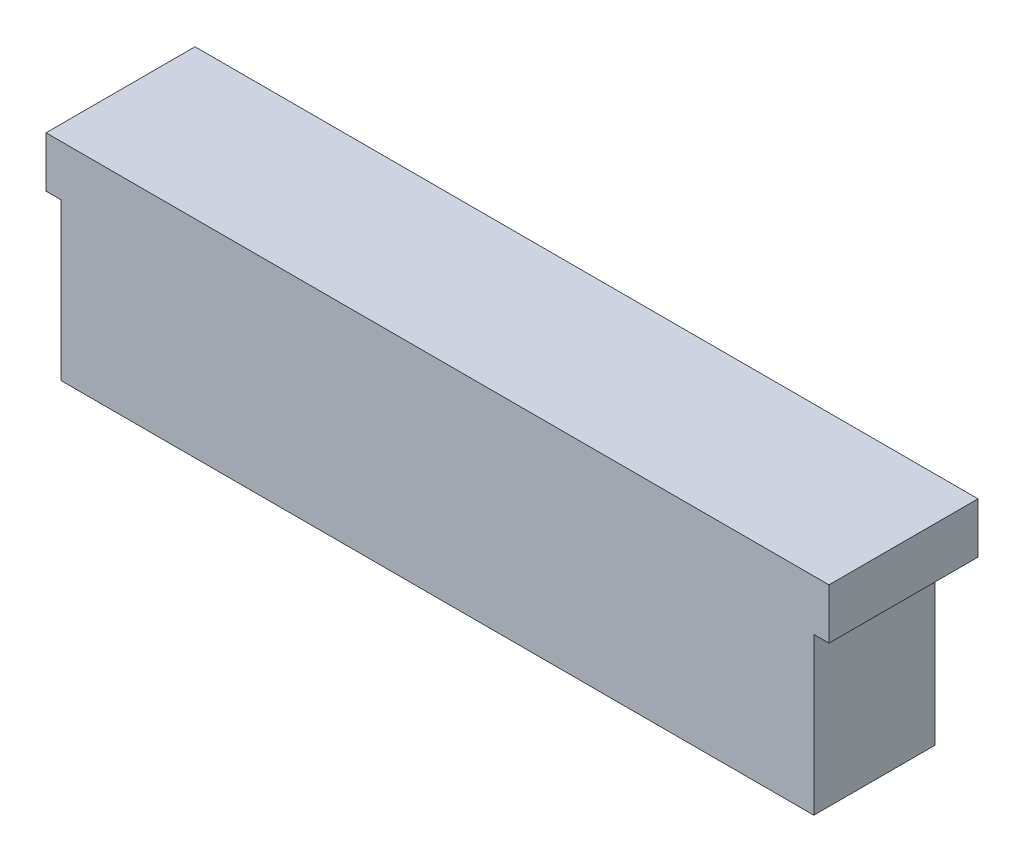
ISO-10303-21;
HEADER;
FILE_DESCRIPTION(('STEP AP214'),'2;1');
FILE_NAME('part.step','',(''),(''),'','','');
FILE_SCHEMA(('AUTOMOTIVE_DESIGN { 1 0 10303 214 1 1 1 1 }'));
ENDSEC;
DATA;
#1=APPLICATION_CONTEXT('core data for automotive mechanical design processes');
#2=APPLICATION_PROTOCOL_DEFINITION('international standard','automotive_design',2000,#1);
#3=PRODUCT_CONTEXT('',#1,'mechanical');
#4=PRODUCT('Part','Part','',(#3));
#5=PRODUCT_RELATED_PRODUCT_CATEGORY('part','',(#4));
#6=PRODUCT_DEFINITION_FORMATION('','',#4);
#7=PRODUCT_DEFINITION_CONTEXT('part definition',#1,'design');
#8=PRODUCT_DEFINITION('design','',#6,#7);
#9=PRODUCT_DEFINITION_SHAPE('','',#8);
#10=(LENGTH_UNIT() NAMED_UNIT(*) SI_UNIT(.MILLI.,.METRE.));
#11=(NAMED_UNIT(*) PLANE_ANGLE_UNIT() SI_UNIT($,.RADIAN.));
#12=(NAMED_UNIT(*) SI_UNIT($,.STERADIAN.) SOLID_ANGLE_UNIT());
#13=UNCERTAINTY_MEASURE_WITH_UNIT(LENGTH_MEASURE(1.E-05),#10,'distance_accuracy_value','');
#14=(GEOMETRIC_REPRESENTATION_CONTEXT(3) GLOBAL_UNCERTAINTY_ASSIGNED_CONTEXT((#13)) GLOBAL_UNIT_ASSIGNED_CONTEXT((#10,
#11,#12)) REPRESENTATION_CONTEXT('',''));
#15=CARTESIAN_POINT('',(0.,0.,0.));
#16=DIRECTION('',(0.,0.,1.));
#17=DIRECTION('',(1.,0.,0.));
#18=AXIS2_PLACEMENT_3D('',#15,#16,#17);
#19=CARTESIAN_POINT('',(7.75,3.1,-1.75));
#20=DIRECTION('',(1.,0.,0.));
#21=DIRECTION('',(0.,1.,0.));
#22=AXIS2_PLACEMENT_3D('',#19,#20,#21);
#23=PLANE('',#22);
#24=DIRECTION('',(0.,0.,-1.));
#25=VECTOR('',#24,1.);
#26=CARTESIAN_POINT('',(7.75,4.1,-1.75));
#27=LINE('',#26,#25);
#28=CARTESIAN_POINT('',(7.75,4.1,1.2));
#29=VERTEX_POINT('',#28);
#30=CARTESIAN_POINT('',(7.75,4.1,-1.75));
#31=VERTEX_POINT('',#30);
#32=EDGE_CURVE('E115',#29,#31,#27,.T.);
#33=ORIENTED_EDGE('',*,*,#32,.F.);
#34=DIRECTION('',(0.,1.,0.));
#35=VECTOR('',#34,1.);
#36=CARTESIAN_POINT('',(7.75,3.1,1.2));
#37=LINE('',#36,#35);
#38=CARTESIAN_POINT('',(7.75,3.1,1.2));
#39=VERTEX_POINT('',#38);
#40=EDGE_CURVE('E157',#39,#29,#37,.T.);
#41=ORIENTED_EDGE('',*,*,#40,.F.);
#42=DIRECTION('',(0.,0.,-1.));
#43=VECTOR('',#42,1.);
#44=CARTESIAN_POINT('',(7.75,3.1,-1.75));
#45=LINE('',#44,#43);
#46=CARTESIAN_POINT('',(7.75,3.1,-1.75));
#47=VERTEX_POINT('',#46);
#48=EDGE_CURVE('E182',#39,#47,#45,.T.);
#49=ORIENTED_EDGE('',*,*,#48,.T.);
#50=DIRECTION('',(0.,1.,0.));
#51=VECTOR('',#50,1.);
#52=CARTESIAN_POINT('',(7.75,3.1,-1.75));
#53=LINE('',#52,#51);
#54=EDGE_CURVE('E11',#47,#31,#53,.T.);
#55=ORIENTED_EDGE('',*,*,#54,.T.);
#56=EDGE_LOOP('',(#33,#41,#49,#55));
#57=FACE_BOUND('',#56,.T.);
#58=ADVANCED_FACE('F17',(#57),#23,.T.);
#59=CARTESIAN_POINT('',(7.75,3.1,-1.75));
#60=DIRECTION('',(0.,0.,-1.));
#61=DIRECTION('',(-1.,0.,0.));
#62=AXIS2_PLACEMENT_3D('',#59,#60,#61);
#63=PLANE('',#62);
#64=DIRECTION('',(-1.,0.,0.));
#65=VECTOR('',#64,1.);
#66=CARTESIAN_POINT('',(7.75,4.1,-1.75));
#67=LINE('',#66,#65);
#68=CARTESIAN_POINT('',(-7.75,4.1,-1.75));
#69=VERTEX_POINT('',#68);
#70=EDGE_CURVE('E166',#31,#69,#67,.T.);
#71=ORIENTED_EDGE('',*,*,#70,.F.);
#72=ORIENTED_EDGE('',*,*,#54,.F.);
#73=DIRECTION('',(-1.,0.,0.));
#74=VECTOR('',#73,1.);
#75=CARTESIAN_POINT('',(7.75,3.1,-1.75));
#76=LINE('',#75,#74);
#77=CARTESIAN_POINT('',(-7.75,3.1,-1.75));
#78=VERTEX_POINT('',#77);
#79=EDGE_CURVE('E179',#47,#78,#76,.T.);
#80=ORIENTED_EDGE('',*,*,#79,.T.);
#81=DIRECTION('',(0.,1.,0.));
#82=VECTOR('',#81,1.);
#83=CARTESIAN_POINT('',(-7.75,3.1,-1.75));
#84=LINE('',#83,#82);
#85=EDGE_CURVE('E20',#78,#69,#84,.T.);
#86=ORIENTED_EDGE('',*,*,#85,.T.);
#87=EDGE_LOOP('',(#71,#72,#80,#86));
#88=FACE_BOUND('',#87,.T.);
#89=ADVANCED_FACE('F193',(#88),#63,.T.);
#90=CARTESIAN_POINT('',(-7.75,3.1,-1.75));
#91=DIRECTION('',(-1.,0.,0.));
#92=DIRECTION('',(0.,0.,1.));
#93=AXIS2_PLACEMENT_3D('',#90,#91,#92);
#94=PLANE('',#93);
#95=DIRECTION('',(0.,0.,1.));
#96=VECTOR('',#95,1.);
#97=CARTESIAN_POINT('',(-7.75,4.1,-1.75));
#98=LINE('',#97,#96);
#99=CARTESIAN_POINT('',(-7.75,4.1,1.2));
#100=VERTEX_POINT('',#99);
#101=EDGE_CURVE('E169',#69,#100,#98,.T.);
#102=ORIENTED_EDGE('',*,*,#101,.F.);
#103=ORIENTED_EDGE('',*,*,#85,.F.);
#104=DIRECTION('',(0.,0.,1.));
#105=VECTOR('',#104,1.);
#106=CARTESIAN_POINT('',(-7.75,3.1,-1.75));
#107=LINE('',#106,#105);
#108=CARTESIAN_POINT('',(-7.75,3.1,1.2));
#109=VERTEX_POINT('',#108);
#110=EDGE_CURVE('E78',#78,#109,#107,.T.);
#111=ORIENTED_EDGE('',*,*,#110,.T.);
#112=DIRECTION('',(0.,1.,0.));
#113=VECTOR('',#112,1.);
#114=CARTESIAN_POINT('',(-7.75,3.1,1.2));
#115=LINE('',#114,#113);
#116=EDGE_CURVE('E156',#109,#100,#115,.T.);
#117=ORIENTED_EDGE('',*,*,#116,.T.);
#118=EDGE_LOOP('',(#102,#103,#111,#117));
#119=FACE_BOUND('',#118,.T.);
#120=ADVANCED_FACE('F194',(#119),#94,.T.);
#121=CARTESIAN_POINT('',(0.,3.1,0.));
#122=DIRECTION('',(0.,-1.,0.));
#123=DIRECTION('',(0.,0.,-1.));
#124=AXIS2_PLACEMENT_3D('',#121,#122,#123);
#125=PLANE('',#124);
#126=DIRECTION('',(0.,0.,1.));
#127=VECTOR('',#126,1.);
#128=CARTESIAN_POINT('',(7.45,3.1,1.2));
#129=LINE('',#128,#127);
#130=CARTESIAN_POINT('',(7.45,3.1,-1.2));
#131=VERTEX_POINT('',#130);
#132=CARTESIAN_POINT('',(7.45,3.1,1.2));
#133=VERTEX_POINT('',#132);
#134=EDGE_CURVE('E149',#131,#133,#129,.T.);
#135=ORIENTED_EDGE('',*,*,#134,.F.);
#136=DIRECTION('',(1.,0.,0.));
#137=VECTOR('',#136,1.);
#138=CARTESIAN_POINT('',(-7.45,3.1,-1.2));
#139=LINE('',#138,#137);
#140=CARTESIAN_POINT('',(-7.45,3.1,-1.2));
#141=VERTEX_POINT('',#140);
#142=EDGE_CURVE('E142',#141,#131,#139,.T.);
#143=ORIENTED_EDGE('',*,*,#142,.F.);
#144=DIRECTION('',(0.,0.,-1.));
#145=VECTOR('',#144,1.);
#146=CARTESIAN_POINT('',(-7.45,3.1,1.2));
#147=LINE('',#146,#145);
#148=CARTESIAN_POINT('',(-7.45,3.1,1.2));
#149=VERTEX_POINT('',#148);
#150=EDGE_CURVE('E127',#149,#141,#147,.T.);
#151=ORIENTED_EDGE('',*,*,#150,.F.);
#152=DIRECTION('',(1.,0.,0.));
#153=VECTOR('',#152,1.);
#154=CARTESIAN_POINT('',(7.75,3.1,1.2));
#155=LINE('',#154,#153);
#156=EDGE_CURVE('E116',#109,#149,#155,.T.);
#157=ORIENTED_EDGE('',*,*,#156,.F.);
#158=ORIENTED_EDGE('',*,*,#110,.F.);
#159=ORIENTED_EDGE('',*,*,#79,.F.);
#160=ORIENTED_EDGE('',*,*,#48,.F.);
#161=DIRECTION('',(1.,0.,0.));
#162=VECTOR('',#161,1.);
#163=CARTESIAN_POINT('',(7.75,3.1,1.2));
#164=LINE('',#163,#162);
#165=EDGE_CURVE('E126',#133,#39,#164,.T.);
#166=ORIENTED_EDGE('',*,*,#165,.F.);
#167=EDGE_LOOP('',(#135,#143,#151,#157,#158,#159,#160,#166));
#168=FACE_BOUND('',#167,.T.);
#169=ADVANCED_FACE('F356',(#168),#125,.T.);
#170=CARTESIAN_POINT('',(0.,0.,0.));
#171=DIRECTION('',(0.,-1.,0.));
#172=DIRECTION('',(0.,0.,-1.));
#173=AXIS2_PLACEMENT_3D('',#170,#171,#172);
#174=PLANE('',#173);
#175=DIRECTION('',(0.,0.,-1.));
#176=VECTOR('',#175,1.);
#177=CARTESIAN_POINT('',(7.45,0.,1.2));
#178=LINE('',#177,#176);
#179=CARTESIAN_POINT('',(7.45,0.,1.2));
#180=VERTEX_POINT('',#179);
#181=CARTESIAN_POINT('',(7.45,0.,-1.2));
#182=VERTEX_POINT('',#181);
#183=EDGE_CURVE('E109',#180,#182,#178,.T.);
#184=ORIENTED_EDGE('',*,*,#183,.F.);
#185=DIRECTION('',(1.,0.,0.));
#186=VECTOR('',#185,1.);
#187=CARTESIAN_POINT('',(-7.45,0.,1.2));
#188=LINE('',#187,#186);
#189=CARTESIAN_POINT('',(-7.45,0.,1.2));
#190=VERTEX_POINT('',#189);
#191=EDGE_CURVE('E102',#190,#180,#188,.T.);
#192=ORIENTED_EDGE('',*,*,#191,.F.);
#193=DIRECTION('',(0.,0.,1.));
#194=VECTOR('',#193,1.);
#195=CARTESIAN_POINT('',(-7.45,0.,1.2));
#196=LINE('',#195,#194);
#197=CARTESIAN_POINT('',(-7.45,0.,-1.2));
#198=VERTEX_POINT('',#197);
#199=EDGE_CURVE('E106',#198,#190,#196,.T.);
#200=ORIENTED_EDGE('',*,*,#199,.F.);
#201=DIRECTION('',(-1.,0.,0.));
#202=VECTOR('',#201,1.);
#203=CARTESIAN_POINT('',(-7.45,0.,-1.2));
#204=LINE('',#203,#202);
#205=EDGE_CURVE('E133',#182,#198,#204,.T.);
#206=ORIENTED_EDGE('',*,*,#205,.F.);
#207=EDGE_LOOP('',(#184,#192,#200,#206));
#208=FACE_BOUND('',#207,.T.);
#209=ADVANCED_FACE('F104',(#208),#174,.T.);
#210=CARTESIAN_POINT('',(0.,4.1,0.));
#211=DIRECTION('',(0.,-1.,0.));
#212=DIRECTION('',(0.,0.,-1.));
#213=AXIS2_PLACEMENT_3D('',#210,#211,#212);
#214=PLANE('',#213);
#215=DIRECTION('',(1.,0.,0.));
#216=VECTOR('',#215,1.);
#217=CARTESIAN_POINT('',(-7.45,4.1,1.2));
#218=LINE('',#217,#216);
#219=EDGE_CURVE('E152',#100,#29,#218,.T.);
#220=ORIENTED_EDGE('',*,*,#219,.T.);
#221=ORIENTED_EDGE('',*,*,#32,.T.);
#222=ORIENTED_EDGE('',*,*,#70,.T.);
#223=ORIENTED_EDGE('',*,*,#101,.T.);
#224=EDGE_LOOP('',(#220,#221,#222,#223));
#225=FACE_BOUND('',#224,.T.);
#226=ADVANCED_FACE('F197',(#225),#214,.F.);
#227=CARTESIAN_POINT('',(-7.45,4.1,1.2));
#228=DIRECTION('',(0.,0.,-1.));
#229=DIRECTION('',(0.,-1.,0.));
#230=AXIS2_PLACEMENT_3D('',#227,#228,#229);
#231=PLANE('',#230);
#232=DIRECTION('',(0.,-1.,0.));
#233=VECTOR('',#232,1.);
#234=CARTESIAN_POINT('',(7.45,4.1,1.2));
#235=LINE('',#234,#233);
#236=EDGE_CURVE('E147',#133,#180,#235,.T.);
#237=ORIENTED_EDGE('',*,*,#236,.F.);
#238=ORIENTED_EDGE('',*,*,#165,.T.);
#239=ORIENTED_EDGE('',*,*,#40,.T.);
#240=ORIENTED_EDGE('',*,*,#219,.F.);
#241=ORIENTED_EDGE('',*,*,#116,.F.);
#242=ORIENTED_EDGE('',*,*,#156,.T.);
#243=DIRECTION('',(0.,-1.,0.));
#244=VECTOR('',#243,1.);
#245=CARTESIAN_POINT('',(-7.45,4.1,1.2));
#246=LINE('',#245,#244);
#247=EDGE_CURVE('E122',#149,#190,#246,.T.);
#248=ORIENTED_EDGE('',*,*,#247,.T.);
#249=ORIENTED_EDGE('',*,*,#191,.T.);
#250=EDGE_LOOP('',(#237,#238,#239,#240,#241,#242,#248,#249));
#251=FACE_BOUND('',#250,.T.);
#252=ADVANCED_FACE('F129',(#251),#231,.F.);
#253=CARTESIAN_POINT('',(-7.45,4.1,1.2));
#254=DIRECTION('',(1.,0.,0.));
#255=DIRECTION('',(0.,1.,0.));
#256=AXIS2_PLACEMENT_3D('',#253,#254,#255);
#257=PLANE('',#256);
#258=ORIENTED_EDGE('',*,*,#247,.F.);
#259=ORIENTED_EDGE('',*,*,#150,.T.);
#260=DIRECTION('',(0.,-1.,0.));
#261=VECTOR('',#260,1.);
#262=CARTESIAN_POINT('',(-7.45,4.1,-1.2));
#263=LINE('',#262,#261);
#264=EDGE_CURVE('E124',#141,#198,#263,.T.);
#265=ORIENTED_EDGE('',*,*,#264,.T.);
#266=ORIENTED_EDGE('',*,*,#199,.T.);
#267=EDGE_LOOP('',(#258,#259,#265,#266));
#268=FACE_BOUND('',#267,.T.);
#269=ADVANCED_FACE('F121',(#268),#257,.F.);
#270=CARTESIAN_POINT('',(-7.45,4.1,-1.2));
#271=DIRECTION('',(0.,0.,1.));
#272=DIRECTION('',(1.,0.,0.));
#273=AXIS2_PLACEMENT_3D('',#270,#271,#272);
#274=PLANE('',#273);
#275=ORIENTED_EDGE('',*,*,#264,.F.);
#276=ORIENTED_EDGE('',*,*,#142,.T.);
#277=DIRECTION('',(0.,-1.,0.));
#278=VECTOR('',#277,1.);
#279=CARTESIAN_POINT('',(7.45,4.1,-1.2));
#280=LINE('',#279,#278);
#281=EDGE_CURVE('E215',#131,#182,#280,.T.);
#282=ORIENTED_EDGE('',*,*,#281,.T.);
#283=ORIENTED_EDGE('',*,*,#205,.T.);
#284=EDGE_LOOP('',(#275,#276,#282,#283));
#285=FACE_BOUND('',#284,.T.);
#286=ADVANCED_FACE('F234',(#285),#274,.F.);
#287=CARTESIAN_POINT('',(7.45,4.1,1.2));
#288=DIRECTION('',(-1.,0.,0.));
#289=DIRECTION('',(0.,0.,1.));
#290=AXIS2_PLACEMENT_3D('',#287,#288,#289);
#291=PLANE('',#290);
#292=ORIENTED_EDGE('',*,*,#281,.F.);
#293=ORIENTED_EDGE('',*,*,#134,.T.);
#294=ORIENTED_EDGE('',*,*,#236,.T.);
#295=ORIENTED_EDGE('',*,*,#183,.T.);
#296=EDGE_LOOP('',(#292,#293,#294,#295));
#297=FACE_BOUND('',#296,.T.);
#298=ADVANCED_FACE('F239',(#297),#291,.F.);
#299=CLOSED_SHELL('',(#58,#89,#120,#169,#209,#226,#252,#269,#286,#298));
#300=MANIFOLD_SOLID_BREP('B1',#299);
#301=ADVANCED_BREP_SHAPE_REPRESENTATION('',(#18,#300),#14);
#302=SHAPE_DEFINITION_REPRESENTATION(#9,#301);
ENDSEC;
END-ISO-10303-21;
